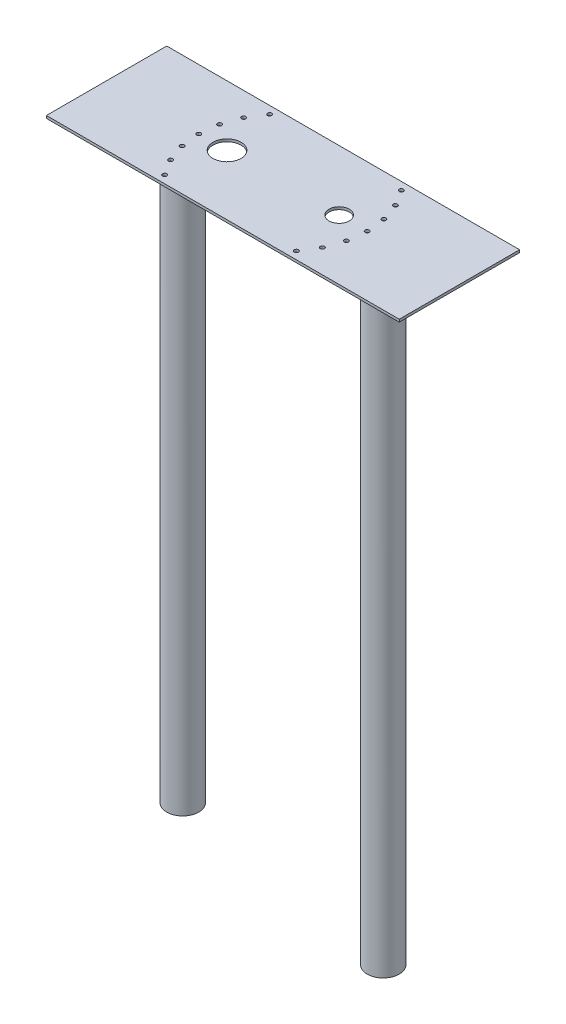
from build123d import *

# Parameters (mm, degrees)
CROQUIS3_W               = 879.9
CROQUIS3_H               = 300.1
SALIENTE_EXTRUIR1_DEPTH  = 6.4
CROQUIS4_R               = 35
CROQUIS4_R_2             = 25.4
CORTAR_EXTRUIR1_DEPTH    = 6.4
CROQUIS9_R               = 5.25
CORTAR_EXTRUIR3_DEPTH    = 10
DESC_ASEGURA_COND_COUNT  = 28
CROQUIS10_R              = 40
PATAS_BASE_CONDENS_DEPTH = 1508


with BuildPart() as part:
    # Croquis3 → Saliente-Extruir1 (new body)
    with BuildSketch(Plane(origin=(0, 0, 0), x_dir=(1, 0, 0), z_dir=(0, 1, 0))):
        with Locations((439.95, 150.05)):
            Rectangle(CROQUIS3_W, CROQUIS3_H)
    extrude(amount=SALIENTE_EXTRUIR1_DEPTH)

    # Croquis4 → Cortar-Extruir1 (cut)
    with BuildSketch(Plane(origin=(0, 6.4, 0), x_dir=(1, 0, 0), z_dir=(0, 1, 0))):
        with Locations(Location((300.4, 150, 0), (0, 0, 270))):
            Circle(CROQUIS4_R)
        with Locations(Location((580, 150, 0), (0, 0, 270))):
            Circle(CROQUIS4_R_2)
    extrude(amount=-CORTAR_EXTRUIR1_DEPTH, mode=Mode.SUBTRACT)

    # Croquis9 → Cortar-Extruir3 (cut)
    with BuildSketch(Plane(origin=(0, 6.4, 0), x_dir=(1, 0, 0), z_dir=(0, 1, 0))):
        with Locations(Location((229.95, 150.05, 0), (0, 0, 270))):
            Circle(CROQUIS9_R)
    cortar_extruir3 = extrude(amount=-CORTAR_EXTRUIR3_DEPTH, mode=Mode.SUBTRACT)

    # DESC_ASEGURA_COND: Cortar-Extruir3 ×28 about axis
    desc_asegura_cond_axis = Axis((439.95, 0, -150.05), (0, 1, 0))
    for i in range(1, DESC_ASEGURA_COND_COUNT):
        add(cortar_extruir3.rotate(desc_asegura_cond_axis, i * 360 / DESC_ASEGURA_COND_COUNT), mode=Mode.SUBTRACT)

    # Croquis10 → PATAS_BASE_CONDENS (add)
    with BuildSketch(Plane.XZ):
        with Locations(Location((739.9, -100, 0), (0, 0, 90))):
            Circle(CROQUIS10_R)
        with Locations(Location((140, -200, 0), (0, 0, 90))):
            Circle(CROQUIS10_R)
    extrude(amount=PATAS_BASE_CONDENS_DEPTH)


solid = part.part
